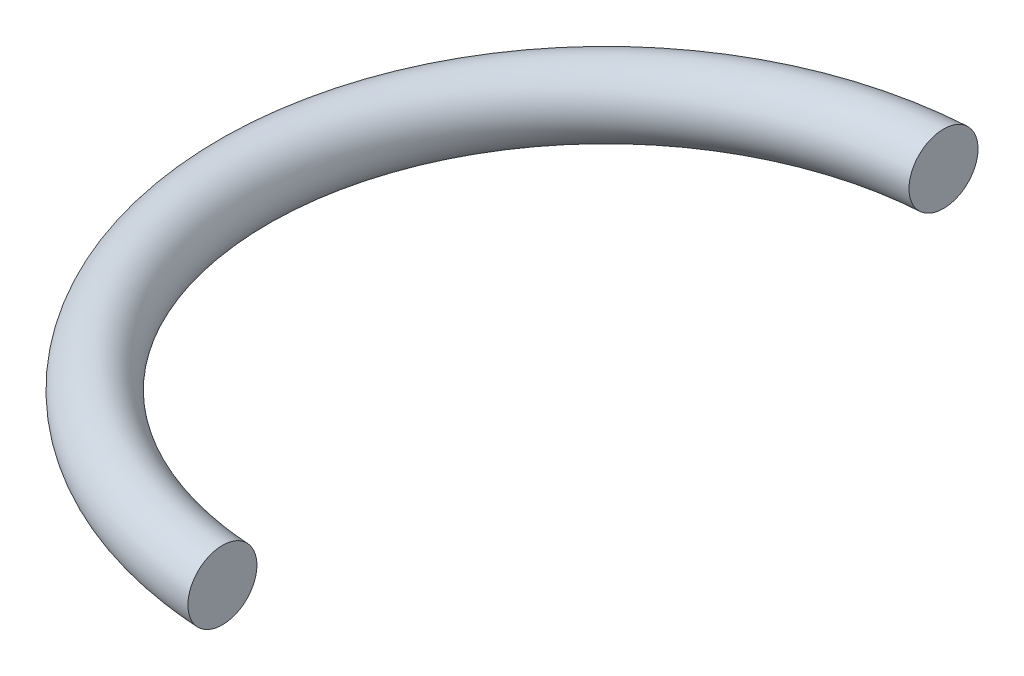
ISO-10303-21;
HEADER;
FILE_DESCRIPTION(('STEP AP214'),'2;1');
FILE_NAME('part.step','',(''),(''),'','','');
FILE_SCHEMA(('AUTOMOTIVE_DESIGN { 1 0 10303 214 1 1 1 1 }'));
ENDSEC;
DATA;
#1=APPLICATION_CONTEXT('core data for automotive mechanical design processes');
#2=APPLICATION_PROTOCOL_DEFINITION('international standard','automotive_design',2000,#1);
#3=PRODUCT_CONTEXT('',#1,'mechanical');
#4=PRODUCT('Part','Part','',(#3));
#5=PRODUCT_RELATED_PRODUCT_CATEGORY('part','',(#4));
#6=PRODUCT_DEFINITION_FORMATION('','',#4);
#7=PRODUCT_DEFINITION_CONTEXT('part definition',#1,'design');
#8=PRODUCT_DEFINITION('design','',#6,#7);
#9=PRODUCT_DEFINITION_SHAPE('','',#8);
#10=(LENGTH_UNIT() NAMED_UNIT(*) SI_UNIT(.MILLI.,.METRE.));
#11=(NAMED_UNIT(*) PLANE_ANGLE_UNIT() SI_UNIT($,.RADIAN.));
#12=(NAMED_UNIT(*) SI_UNIT($,.STERADIAN.) SOLID_ANGLE_UNIT());
#13=UNCERTAINTY_MEASURE_WITH_UNIT(LENGTH_MEASURE(1.E-05),#10,'distance_accuracy_value','');
#14=(GEOMETRIC_REPRESENTATION_CONTEXT(3) GLOBAL_UNCERTAINTY_ASSIGNED_CONTEXT((#13)) GLOBAL_UNIT_ASSIGNED_CONTEXT((#10,
#11,#12)) REPRESENTATION_CONTEXT('',''));
#15=CARTESIAN_POINT('',(0.,0.,0.));
#16=DIRECTION('',(0.,0.,1.));
#17=DIRECTION('',(1.,0.,0.));
#18=AXIS2_PLACEMENT_3D('',#15,#16,#17);
#19=CARTESIAN_POINT('',(0.,0.,0.));
#20=DIRECTION('',(0.,0.999999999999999,0.));
#21=DIRECTION('',(0.,0.,1.));
#22=AXIS2_PLACEMENT_3D('',#19,#20,#21);
#23=TOROIDAL_SURFACE('',#22,16.,1.525);
#24=CARTESIAN_POINT('',(-0.999997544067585,-0.483991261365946,14.5194421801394));
#25=CARTESIAN_POINT('',(-0.999996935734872,-0.402954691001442,14.4922605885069));
#26=CARTESIAN_POINT('',(-0.999999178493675,-0.319564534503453,14.4719015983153));
#27=CARTESIAN_POINT('',(-1.00000082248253,-0.150481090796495,14.4454561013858));
#28=CARTESIAN_POINT('',(-1.00000022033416,-0.0647851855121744,14.4393865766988));
#29=CARTESIAN_POINT('',(-0.999999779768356,0.10637654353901,14.44173043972));
#30=CARTESIAN_POINT('',(-0.999999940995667,0.191842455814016,14.4501370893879));
#31=CARTESIAN_POINT('',(-1.00000005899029,0.360126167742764,14.4811776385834));
#32=CARTESIAN_POINT('',(-1.00000001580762,0.442944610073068,14.5038080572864));
#33=CARTESIAN_POINT('',(-0.999999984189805,0.603624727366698,14.5626455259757));
#34=CARTESIAN_POINT('',(-0.999999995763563,0.681485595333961,14.5988547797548));
#35=CARTESIAN_POINT('',(-1.00000000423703,0.830038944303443,14.6838130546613));
#36=CARTESIAN_POINT('',(-1.00000000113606,0.90073109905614,14.7325626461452));
#37=CARTESIAN_POINT('',(-0.999999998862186,1.03305604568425,14.8412928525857));
#38=CARTESIAN_POINT('',(-0.999999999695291,1.09467480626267,14.9012905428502));
#39=CARTESIAN_POINT('',(-1.00000000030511,1.20699216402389,15.0307589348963));
#40=CARTESIAN_POINT('',(-1.00000000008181,1.25769065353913,15.1002297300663));
#41=CARTESIAN_POINT('',(-0.999999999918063,1.34684657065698,15.2468376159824));
#42=CARTESIAN_POINT('',(-0.999999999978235,1.38527665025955,15.323991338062));
#43=CARTESIAN_POINT('',(-1.00000000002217,1.44866416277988,15.4836476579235));
#44=CARTESIAN_POINT('',(-1.00000000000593,1.47362147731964,15.5661503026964));
#45=CARTESIAN_POINT('',(-0.999999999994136,1.50939441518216,15.7343166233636));
#46=CARTESIAN_POINT('',(-0.999999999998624,1.52018544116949,15.8199855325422));
#47=CARTESIAN_POINT('',(-1.00000000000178,1.52724021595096,15.9919197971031));
#48=CARTESIAN_POINT('',(-1.00000000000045,1.5235038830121,16.0781851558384));
#49=CARTESIAN_POINT('',(-0.999999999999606,1.5016000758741,16.2489099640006));
#50=CARTESIAN_POINT('',(-1.00000000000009,1.48342511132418,16.3333684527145));
#51=CARTESIAN_POINT('',(-1.00000000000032,1.43314319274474,16.4980314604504));
#52=CARTESIAN_POINT('',(-1.00000000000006,1.40103627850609,16.5782359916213));
#53=CARTESIAN_POINT('',(-0.999999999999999,1.32382302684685,16.7320471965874));
#54=CARTESIAN_POINT('',(-1.0000000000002,1.27872650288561,16.8056587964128));
#55=CARTESIAN_POINT('',(-1.00000000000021,1.17679704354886,16.9442506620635));
#56=CARTESIAN_POINT('',(-1.00000000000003,1.11996419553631,17.0092309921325));
#57=CARTESIAN_POINT('',(-1.00000000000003,0.996269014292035,17.1286067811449));
#58=CARTESIAN_POINT('',(-1.00000000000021,0.92942241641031,17.183018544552));
#59=CARTESIAN_POINT('',(-1.00000000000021,0.787530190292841,17.2798247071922));
#60=CARTESIAN_POINT('',(-1.00000000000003,0.712484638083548,17.3222192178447));
#61=CARTESIAN_POINT('',(-1.00000000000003,0.556460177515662,17.3937138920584));
#62=CARTESIAN_POINT('',(-1.00000000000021,0.475491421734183,17.4228362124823));
#63=CARTESIAN_POINT('',(-1.00000000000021,0.309810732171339,17.4670558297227));
#64=CARTESIAN_POINT('',(-1.00000000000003,0.225098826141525,17.482153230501));
#65=CARTESIAN_POINT('',(-1.00000000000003,0.0544439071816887,17.4978804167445));
#66=CARTESIAN_POINT('',(-1.00000000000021,-0.0314975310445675,17.4985272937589));
#67=CARTESIAN_POINT('',(-1.00000000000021,-0.202268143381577,17.4853785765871));
#68=CARTESIAN_POINT('',(-1.00000000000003,-0.287097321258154,17.4715830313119));
#69=CARTESIAN_POINT('',(-1.00000000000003,-0.453209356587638,17.4299511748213));
#70=CARTESIAN_POINT('',(-1.00000000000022,-0.534493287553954,17.402119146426));
#71=CARTESIAN_POINT('',(-1.0000000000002,-0.691239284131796,17.3332125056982));
#72=CARTESIAN_POINT('',(-0.999999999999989,-0.766701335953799,17.2921378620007));
#73=CARTESIAN_POINT('',(-1.00000000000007,-0.909717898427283,17.197886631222));
#74=CARTESIAN_POINT('',(-1.00000000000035,-0.977267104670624,17.1447019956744));
#75=CARTESIAN_POINT('',(-1.00000000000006,-1.1024935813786,17.0277618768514));
#76=CARTESIAN_POINT('',(-0.999999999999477,-1.16017079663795,16.9640063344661));
#77=CARTESIAN_POINT('',(-1.00000000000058,-1.26410580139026,16.8276382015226));
#78=CARTESIAN_POINT('',(-1.00000000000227,-1.31034717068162,16.7550130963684));
#79=CARTESIAN_POINT('',(-0.999999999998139,-1.39000507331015,16.6030406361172));
#80=CARTESIAN_POINT('',(-0.999999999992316,-1.42342146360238,16.523693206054));
#81=CARTESIAN_POINT('',(-1.00000000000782,-1.47654006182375,16.360383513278));
#82=CARTESIAN_POINT('',(-1.0000000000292,-1.49621876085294,16.2764136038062));
#83=CARTESIAN_POINT('',(-0.999999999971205,-1.52122030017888,16.1063628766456));
#84=CARTESIAN_POINT('',(-0.999999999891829,-1.52654298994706,16.0202820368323));
#85=CARTESIAN_POINT('',(-1.00000000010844,-1.52268336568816,15.8483295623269));
#86=CARTESIAN_POINT('',(-1.00000000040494,-1.51348146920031,15.7624583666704));
#87=CARTESIAN_POINT('',(-0.999999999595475,-1.4807970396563,15.5934811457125));
#88=CARTESIAN_POINT('',(-0.999999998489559,-1.45731500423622,15.5103750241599));
#89=CARTESIAN_POINT('',(-1.00000000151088,-1.39672610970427,15.3492675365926));
#90=CARTESIAN_POINT('',(-1.00000000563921,-1.35961640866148,15.2712672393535));
#91=CARTESIAN_POINT('',(-0.999999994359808,-1.27280440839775,15.1225918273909));
#92=CARTESIAN_POINT('',(-0.999999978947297,-1.22309903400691,15.0519185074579));
#93=CARTESIAN_POINT('',(-1.0000000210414,-1.11254420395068,14.9199803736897));
#94=CARTESIAN_POINT('',(-1.00000007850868,-1.05170077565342,14.8587105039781));
#95=CARTESIAN_POINT('',(-0.999999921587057,-0.920615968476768,14.7473417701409));
#96=CARTESIAN_POINT('',(-0.999999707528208,-0.850386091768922,14.6972294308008));
#97=CARTESIAN_POINT('',(-1.00000018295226,-0.730276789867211,14.6259991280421));
#98=CARTESIAN_POINT('',(-1.00000056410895,-0.682624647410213,14.601050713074));
#99=CARTESIAN_POINT('',(-0.999999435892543,-0.58495551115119,14.5563167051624));
#100=CARTESIAN_POINT('',(-0.999997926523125,-0.534938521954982,14.5365311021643));
#101=CARTESIAN_POINT('',(-0.999997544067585,-0.483991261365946,14.5194421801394));
#102=B_SPLINE_CURVE_WITH_KNOTS('',3,(#24,#25,#26,#27,#28,#29,#30,#31,#32,#33,#34,#35,#36,#37,
#38,#39,#40,#41,#42,#43,#44,#45,#46,#47,#48,#49,#50,#51,#52,#53,#54,#55,#56,#57,#58,#59,#60,#61,
#62,#63,#64,#65,#66,#67,#68,#69,#70,#71,#72,#73,#74,#75,#76,#77,#78,#79,#80,#81,#82,#83,#84,#85,
#86,#87,#88,#89,#90,#91,#92,#93,#94,#95,#96,#97,#98,#99,#100,#101),.UNSPECIFIED.,.T.,.F.,(4,2,2,
2,2,2,2,2,2,2,2,2,2,2,2,2,2,2,2,2,2,2,2,2,2,2,2,2,2,2,2,2,2,2,2,2,2,2,4),(0.,0.25622555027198,
0.512755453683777,0.769165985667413,1.02551379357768,1.28190322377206,1.53830431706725,
1.79509784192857,2.05189389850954,2.30925845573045,2.56662527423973,2.82443837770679,
3.08225293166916,3.34020131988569,3.59814897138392,3.85590225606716,4.11365362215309,
4.3710041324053,4.62835225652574,4.88526917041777,5.14218417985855,5.3987953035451,
5.6554055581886,5.91193756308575,6.16847017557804,6.42517378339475,6.68187882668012,
6.93895034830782,7.19602473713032,7.45353797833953,7.71105391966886,7.96891734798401,
8.22677179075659,8.48468003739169,8.74265131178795,9.00048339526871,9.25800237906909,
9.41909033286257,9.58017797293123),.UNSPECIFIED.);
#103=CARTESIAN_POINT('',(-0.999997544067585,-0.483991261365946,14.5194421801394));
#104=VERTEX_POINT('',#103);
#105=EDGE_CURVE('E36',#104,#104,#102,.T.);
#106=ORIENTED_EDGE('',*,*,#105,.F.);
#107=EDGE_LOOP('',(#106));
#108=FACE_BOUND('',#107,.T.);
#109=CARTESIAN_POINT('',(-1.00000000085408,-0.921068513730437,-17.1863566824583));
#110=CARTESIAN_POINT('',(-1.00000000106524,-0.852897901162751,-17.238100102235));
#111=CARTESIAN_POINT('',(-1.00000000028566,-0.780312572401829,-17.2841294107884));
#112=CARTESIAN_POINT('',(-0.999999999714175,-0.628384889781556,-17.3633878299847));
#113=CARTESIAN_POINT('',(-0.999999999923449,-0.549034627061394,-17.3966017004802));
#114=CARTESIAN_POINT('',(-1.0000000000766,-0.385909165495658,-17.4492170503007));
#115=CARTESIAN_POINT('',(-1.0000000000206,-0.302135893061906,-17.4686244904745));
#116=CARTESIAN_POINT('',(-0.999999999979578,-0.132542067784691,-17.4930833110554));
#117=CARTESIAN_POINT('',(-0.999999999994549,-0.0467220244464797,-17.498138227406));
#118=CARTESIAN_POINT('',(-1.00000000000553,0.124502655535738,-17.4937603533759));
#119=CARTESIAN_POINT('',(-1.00000000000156,0.209907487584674,-17.4843352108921));
#120=CARTESIAN_POINT('',(-0.999999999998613,0.377925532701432,-17.4512802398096));
#121=CARTESIAN_POINT('',(-0.999999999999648,0.460538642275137,-17.4276498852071));
#122=CARTESIAN_POINT('',(-1.00000000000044,0.620628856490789,-17.3668598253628));
#123=CARTESIAN_POINT('',(-1.00000000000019,0.698105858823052,-17.3296998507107));
#124=CARTESIAN_POINT('',(-0.999999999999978,0.845729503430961,-17.2429121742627));
#125=CARTESIAN_POINT('',(-1.00000000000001,0.915876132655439,-17.1932844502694));
#126=CARTESIAN_POINT('',(-1.00000000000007,1.04692347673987,-17.0829214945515));
#127=CARTESIAN_POINT('',(-1.0000000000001,1.10781513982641,-17.0221755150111));
#128=CARTESIAN_POINT('',(-1.00000000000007,1.21855530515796,-16.8913373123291));
#129=CARTESIAN_POINT('',(-1.,1.26840373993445,-16.8212450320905));
#130=CARTESIAN_POINT('',(-1.00000000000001,1.35572813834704,-16.6735850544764));
#131=CARTESIAN_POINT('',(-1.00000000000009,1.3931842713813,-16.5960056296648));
#132=CARTESIAN_POINT('',(-1.00000000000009,1.45456500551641,-16.4356666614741));
#133=CARTESIAN_POINT('',(-1.00000000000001,1.47848946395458,-16.3529070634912));
#134=CARTESIAN_POINT('',(-1.00000000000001,1.51216694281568,-16.1844102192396));
#135=CARTESIAN_POINT('',(-1.00000000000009,1.52189642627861,-16.0986682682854));
#136=CARTESIAN_POINT('',(-1.00000000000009,1.52683885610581,-15.9267668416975));
#137=CARTESIAN_POINT('',(-1.,1.52205170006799,-15.8406073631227));
#138=CARTESIAN_POINT('',(-1.00000000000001,1.49808487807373,-15.6702221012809));
#139=CARTESIAN_POINT('',(-1.0000000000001,1.47889024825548,-15.5859984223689));
#140=CARTESIAN_POINT('',(-1.00000000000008,1.42663185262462,-15.4219692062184));
#141=CARTESIAN_POINT('',(-0.999999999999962,1.39356806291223,-15.3421636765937));
#142=CARTESIAN_POINT('',(-0.99999999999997,1.31450796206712,-15.189252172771));
#143=CARTESIAN_POINT('',(-1.00000000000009,1.26851347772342,-15.1161452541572));
#144=CARTESIAN_POINT('',(-1.00000000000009,1.16488713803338,-14.9787051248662));
#145=CARTESIAN_POINT('',(-0.999999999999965,1.1072553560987,-14.9143718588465));
#146=CARTESIAN_POINT('',(-0.999999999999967,0.982075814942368,-14.7964085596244));
#147=CARTESIAN_POINT('',(-1.0000000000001,0.914542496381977,-14.7427632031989));
#148=CARTESIAN_POINT('',(-1.00000000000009,0.771411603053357,-14.6476013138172));
#149=CARTESIAN_POINT('',(-0.999999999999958,0.695814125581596,-14.6060846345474));
#150=CARTESIAN_POINT('',(-0.99999999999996,0.538878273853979,-14.5364549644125));
#151=CARTESIAN_POINT('',(-1.0000000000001,0.457552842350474,-14.5083128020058));
#152=CARTESIAN_POINT('',(-1.00000000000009,0.291327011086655,-14.4661097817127));
#153=CARTESIAN_POINT('',(-0.999999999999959,0.206426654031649,-14.4520487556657));
#154=CARTESIAN_POINT('',(-0.999999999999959,0.0356285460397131,-14.438427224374));
#155=CARTESIAN_POINT('',(-1.00000000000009,-0.0502670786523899,-14.4388400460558));
#156=CARTESIAN_POINT('',(-1.00000000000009,-0.220768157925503,-14.4540880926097));
#157=CARTESIAN_POINT('',(-0.999999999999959,-0.305373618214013,-14.4689232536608));
#158=CARTESIAN_POINT('',(-0.999999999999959,-0.470853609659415,-14.5125778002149));
#159=CARTESIAN_POINT('',(-1.00000000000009,-0.551729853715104,-14.541390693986));
#160=CARTESIAN_POINT('',(-1.00000000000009,-0.707505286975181,-14.6121698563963));
#161=CARTESIAN_POINT('',(-0.99999999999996,-0.782404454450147,-14.6541361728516));
#162=CARTESIAN_POINT('',(-0.999999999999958,-0.924198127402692,-14.7500784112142));
#163=CARTESIAN_POINT('',(-1.00000000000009,-0.991083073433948,-14.8040684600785));
#164=CARTESIAN_POINT('',(-1.0000000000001,-1.1148640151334,-14.9224894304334));
#165=CARTESIAN_POINT('',(-0.999999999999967,-1.17175988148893,-14.9869204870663));
#166=CARTESIAN_POINT('',(-0.999999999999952,-1.27407762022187,-15.1245420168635));
#167=CARTESIAN_POINT('',(-1.00000000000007,-1.31947463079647,-15.1977509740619));
#168=CARTESIAN_POINT('',(-1.00000000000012,-1.39736189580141,-15.3507399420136));
#169=CARTESIAN_POINT('',(-1.00000000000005,-1.42985197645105,-15.4305200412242));
#170=CARTESIAN_POINT('',(-0.999999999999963,-1.48106589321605,-15.5945570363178));
#171=CARTESIAN_POINT('',(-0.999999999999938,-1.49976228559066,-15.678822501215));
#172=CARTESIAN_POINT('',(-1.00000000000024,-1.52275603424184,-15.8492925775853));
#173=CARTESIAN_POINT('',(-1.00000000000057,-1.52705385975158,-15.9354971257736));
#174=CARTESIAN_POINT('',(-0.999999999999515,-1.52112698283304,-16.1074733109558));
#175=CARTESIAN_POINT('',(-0.999999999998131,-1.51089088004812,-16.1932445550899));
#176=CARTESIAN_POINT('',(-1.00000000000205,-1.47615372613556,-16.3618727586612));
#177=CARTESIAN_POINT('',(-1.00000000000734,-1.45164914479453,-16.4447289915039));
#178=CARTESIAN_POINT('',(-0.99999999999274,-1.3890667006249,-16.605142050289));
#179=CARTESIAN_POINT('',(-0.999999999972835,-1.35098822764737,-16.6826986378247));
#180=CARTESIAN_POINT('',(-1.00000000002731,-1.26235482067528,-16.830233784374));
#181=CARTESIAN_POINT('',(-1.00000000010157,-1.21181502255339,-16.9002213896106));
#182=CARTESIAN_POINT('',(-0.99999999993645,-1.12070901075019,-17.0062581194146));
#183=CARTESIAN_POINT('',(-0.999999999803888,-1.08347170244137,-17.0452174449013));
#184=CARTESIAN_POINT('',(-1.00000000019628,-1.0050948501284,-17.1189905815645));
#185=CARTESIAN_POINT('',(-1.00000000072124,-0.963955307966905,-17.1538043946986));
#186=CARTESIAN_POINT('',(-1.00000000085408,-0.921068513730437,-17.1863566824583));
#187=B_SPLINE_CURVE_WITH_KNOTS('',3,(#109,#110,#111,#112,#113,#114,#115,#116,#117,#118,#119,
#120,#121,#122,#123,#124,#125,#126,#127,#128,#129,#130,#131,#132,#133,#134,#135,#136,#137,#138,
#139,#140,#141,#142,#143,#144,#145,#146,#147,#148,#149,#150,#151,#152,#153,#154,#155,#156,#157,
#158,#159,#160,#161,#162,#163,#164,#165,#166,#167,#168,#169,#170,#171,#172,#173,#174,#175,#176,
#177,#178,#179,#180,#181,#182,#183,#184,#185,#186),.UNSPECIFIED.,.T.,.F.,(4,2,2,2,2,2,2,2,2,2,2,
2,2,2,2,2,2,2,2,2,2,2,2,2,2,2,2,2,2,2,2,2,2,2,2,2,2,2,4),(0.,0.256555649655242,
0.513415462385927,0.770164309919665,1.02684989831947,1.28339996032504,1.53995952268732,
1.79652419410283,2.05308932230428,2.3099037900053,2.56671982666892,2.82394486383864,
3.08117261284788,3.33882639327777,3.59648199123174,3.85440556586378,4.11232958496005,
4.37021718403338,4.62810315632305,4.88561669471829,5.1431271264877,5.400073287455,
5.65701637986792,5.91348599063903,6.1699544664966,6.42630394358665,6.68265435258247,
6.9393075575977,7.19596408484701,7.45317088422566,7.71038114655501,7.96810178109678,
8.22581401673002,8.48372851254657,8.74170684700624,8.99969677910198,9.25737487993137,
9.41877660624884,9.580178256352),.UNSPECIFIED.);
#188=CARTESIAN_POINT('',(-1.00000000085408,-0.921068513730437,-17.1863566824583));
#189=VERTEX_POINT('',#188);
#190=EDGE_CURVE('E10',#189,#189,#187,.T.);
#191=ORIENTED_EDGE('',*,*,#190,.F.);
#192=EDGE_LOOP('',(#191));
#193=FACE_BOUND('',#192,.T.);
#194=ADVANCED_FACE('F27',(#108,#193),#23,.T.);
#195=CARTESIAN_POINT('',(-1.00000000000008,62.0774151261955,-18.7733448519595));
#196=DIRECTION('',(1.,0.,0.));
#197=DIRECTION('',(0.,0.,-1.));
#198=AXIS2_PLACEMENT_3D('',#195,#196,#197);
#199=PLANE('',#198);
#200=ORIENTED_EDGE('',*,*,#105,.T.);
#201=EDGE_LOOP('',(#200));
#202=FACE_BOUND('',#201,.T.);
#203=ADVANCED_FACE('F47',(#202),#199,.T.);
#204=ORIENTED_EDGE('',*,*,#190,.T.);
#205=EDGE_LOOP('',(#204));
#206=FACE_BOUND('',#205,.T.);
#207=ADVANCED_FACE('F44',(#206),#199,.T.);
#208=CLOSED_SHELL('',(#194,#203,#207));
#209=MANIFOLD_SOLID_BREP('B2',#208);
#210=ADVANCED_BREP_SHAPE_REPRESENTATION('',(#18,#209),#14);
#211=SHAPE_DEFINITION_REPRESENTATION(#9,#210);
ENDSEC;
END-ISO-10303-21;
